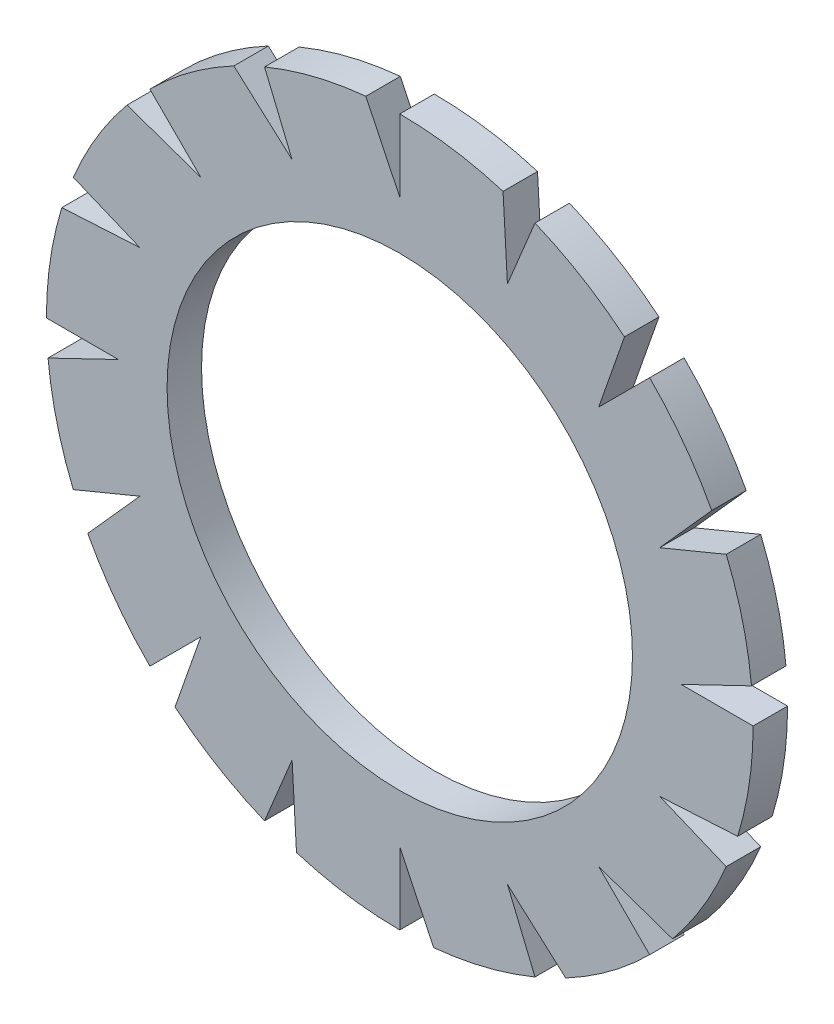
from build123d import *

# Parameters (mm, degrees)
BODYSKE_W      = 3.5
BODYSKE_H      = 1
TOOTHCUT_DEPTH = 15.530141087
TOOTHPAT_COUNT = 16


with BuildPart() as part:
    # BodySke → BaseBody (revolve)
    with BuildSketch(Plane(origin=(0, 0, 0), x_dir=(1, 0, 0), z_dir=(0, 1, 0))):
        with Locations((8.5, 0.5)):
            Rectangle(BODYSKE_W, BODYSKE_H)
    revolve(axis=Axis((0, 0, 0), (0, 0, -1)))

    # ToothSke → ToothCut (cut, through all)
    with BuildSketch(Plane.XY):
        Polygon((0, 8.16), (0, 10.25), (-1.006291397, 10.25), align=None)
    toothcut = extrude(amount=-TOOTHCUT_DEPTH, mode=Mode.SUBTRACT)

    # ToothPat: ToothCut ×16 about axis
    toothpat_axis = Axis((0, 0, 0), (0, 0, 1))
    for i in range(1, TOOTHPAT_COUNT):
        add(toothcut.rotate(toothpat_axis, i * 360 / TOOTHPAT_COUNT), mode=Mode.SUBTRACT)


solid = part.part
